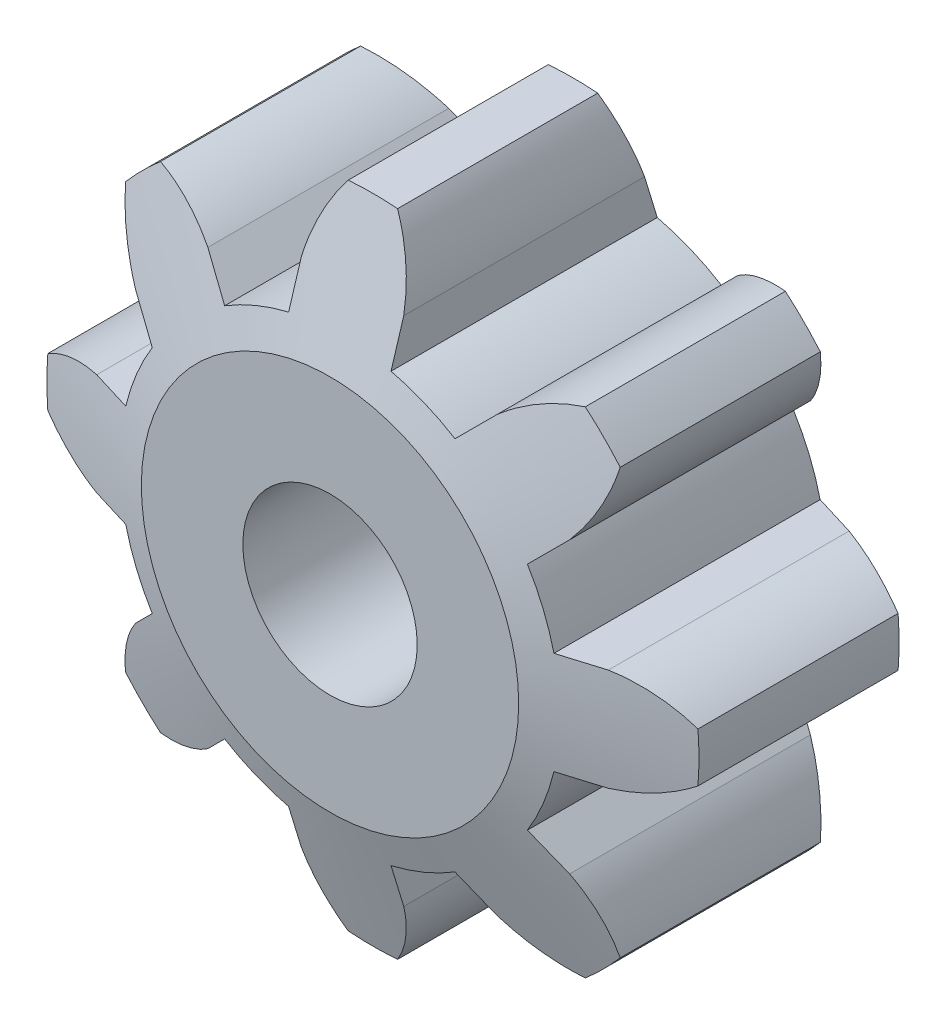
from build123d import *

# Parameters (mm, degrees)
CUT_EXTRUDE3_DEPTH      = 19.97756702
CUT_EXTRUDE3_DEPTH_BACK = 19.97756702
CUT_EXTRUDE4_DEPTH      = 19.977567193
CUT_EXTRUDE4_DEPTH_BACK = 19.977567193
SKETCH5_R               = 3.05


with BuildPart() as part:
    # Sketch1 → Revolve1 (revolve)
    with BuildSketch(Plane(origin=(0, 0, 0), x_dir=(0, 0, -1), z_dir=(1, 0, 0)), mode=Mode.PRIVATE) as revolve1_sk:
        Polygon((-5, 0), (5, 0), (5, 6.6), (3.5, 11.405), (-3.5, 11.405), (-5, 6.6), align=None)
    revolve(revolve1_sk.sketch.rotate(Axis((0, 0, 5), (0, 0, -1)), 90), axis=Axis((0, 0, 5), (0, 0, -1)))

    # Sketch2 → Cut-Extrude3 (cut, two sides: drawn at the far end of the back side and taken through both)
    with BuildSketch(Plane.XY.offset(5).offset(-CUT_EXTRUDE3_DEPTH_BACK)):
        with BuildLine():
            ThreePointArc((-4.029014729, 6.561786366), (-2.946662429, 7.1138724), (-1.79094, 7.488827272))
            Line((-1.79094, 7.488827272), (-1.79094, 8.947522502))
            ThreePointArc((-1.79094, 8.947522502), (-1.487561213, 10.221079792), (-0.863985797, 11.37222729))
            ThreePointArc((-0.863985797, 11.37222729), (-4.364504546, 10.536846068), (-7.430448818, 8.65230925))
            ThreePointArc((-7.430448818, 8.65230925), (-6.175530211, 8.279259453), (-5.060468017, 7.593239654))
            Line((-5.060468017, 7.593239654), (-4.029014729, 6.561786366))
        make_face()
        with BuildLine():
            ThreePointArc((1.79094, 7.488827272), (2.946662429, 7.1138724), (4.029014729, 6.561786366))
            Line((4.029014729, 6.561786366), (5.060468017, 7.593239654))
            ThreePointArc((5.060468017, 7.593239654), (6.175530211, 8.279259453), (7.430448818, 8.65230925))
            ThreePointArc((7.430448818, 8.65230925), (4.364504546, 10.536846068), (0.863985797, 11.37222729))
            ThreePointArc((0.863985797, 11.37222729), (1.487561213, 10.221079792), (1.79094, 8.947522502))
            Line((1.79094, 8.947522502), (1.79094, 7.488827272))
        make_face()
        with BuildLine():
            Line((7.593239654, 5.060468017), (6.561786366, 4.029014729))
            ThreePointArc((6.561786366, 4.029014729), (7.1138724, 2.946662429), (7.488827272, 1.79094))
            Line((7.488827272, 1.79094), (8.947522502, 1.79094))
            ThreePointArc((8.947522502, 1.79094), (10.221079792, 1.487561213), (11.37222729, 0.863985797))
            ThreePointArc((11.37222729, 0.863985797), (10.536846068, 4.364504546), (8.65230925, 7.430448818))
            ThreePointArc((8.65230925, 7.430448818), (8.279259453, 6.175530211), (7.593239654, 5.060468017))
        make_face()
        with BuildLine():
            Line((8.947522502, -1.79094), (7.488827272, -1.79094))
            ThreePointArc((7.488827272, -1.79094), (7.1138724, -2.946662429), (6.561786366, -4.029014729))
            Line((6.561786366, -4.029014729), (7.593239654, -5.060468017))
            ThreePointArc((7.593239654, -5.060468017), (8.279259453, -6.175530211), (8.65230925, -7.430448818))
            ThreePointArc((8.65230925, -7.430448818), (10.536846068, -4.364504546), (11.37222729, -0.863985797))
            ThreePointArc((11.37222729, -0.863985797), (10.221079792, -1.487561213), (8.947522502, -1.79094))
        make_face()
        with BuildLine():
            Line((5.060468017, -7.593239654), (4.029014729, -6.561786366))
            ThreePointArc((4.029014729, -6.561786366), (2.946662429, -7.1138724), (1.79094, -7.488827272))
            Line((1.79094, -7.488827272), (1.79094, -8.947522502))
            ThreePointArc((1.79094, -8.947522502), (1.487561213, -10.221079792), (0.863985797, -11.37222729))
            ThreePointArc((0.863985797, -11.37222729), (4.364504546, -10.536846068), (7.430448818, -8.65230925))
            ThreePointArc((7.430448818, -8.65230925), (6.175530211, -8.279259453), (5.060468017, -7.593239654))
        make_face()
        with BuildLine():
            Line((-1.79094, -8.947522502), (-1.79094, -7.488827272))
            ThreePointArc((-1.79094, -7.488827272), (-2.946662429, -7.1138724), (-4.029014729, -6.561786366))
            Line((-4.029014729, -6.561786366), (-5.060468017, -7.593239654))
            ThreePointArc((-5.060468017, -7.593239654), (-6.175530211, -8.279259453), (-7.430448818, -8.65230925))
            ThreePointArc((-7.430448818, -8.65230925), (-4.364504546, -10.536846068), (-0.863985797, -11.37222729))
            ThreePointArc((-0.863985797, -11.37222729), (-1.487561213, -10.221079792), (-1.79094, -8.947522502))
        make_face()
        with BuildLine():
            ThreePointArc((-6.561786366, -4.029014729), (-7.1138724, -2.946662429), (-7.488827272, -1.79094))
            Line((-7.488827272, -1.79094), (-8.947522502, -1.79094))
            ThreePointArc((-8.947522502, -1.79094), (-10.221079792, -1.487561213), (-11.37222729, -0.863985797))
            ThreePointArc((-11.37222729, -0.863985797), (-10.536846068, -4.364504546), (-8.65230925, -7.430448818))
            ThreePointArc((-8.65230925, -7.430448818), (-8.279259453, -6.175530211), (-7.593239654, -5.060468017))
            Line((-7.593239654, -5.060468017), (-6.561786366, -4.029014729))
        make_face()
        with BuildLine():
            ThreePointArc((-7.488827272, 1.79094), (-7.1138724, 2.946662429), (-6.561786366, 4.029014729))
            Line((-6.561786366, 4.029014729), (-7.593239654, 5.060468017))
            ThreePointArc((-7.593239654, 5.060468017), (-8.279259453, 6.175530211), (-8.65230925, 7.430448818))
            ThreePointArc((-8.65230925, 7.430448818), (-10.536846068, 4.364504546), (-11.37222729, 0.863985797))
            ThreePointArc((-11.37222729, 0.863985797), (-10.221079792, 1.487561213), (-8.947522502, 1.79094))
            Line((-8.947522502, 1.79094), (-7.488827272, 1.79094))
        make_face()
    extrude(amount=CUT_EXTRUDE3_DEPTH + CUT_EXTRUDE3_DEPTH_BACK, mode=Mode.SUBTRACT)

    # Sketch5 → Cut-Extrude4 (cut, two sides: drawn at the far end of the back side and taken through both)
    with BuildSketch(Plane.XY.offset(5).offset(-CUT_EXTRUDE4_DEPTH_BACK)):
        Circle(SKETCH5_R)
    extrude(amount=CUT_EXTRUDE4_DEPTH + CUT_EXTRUDE4_DEPTH_BACK, mode=Mode.SUBTRACT)


solid = part.part
